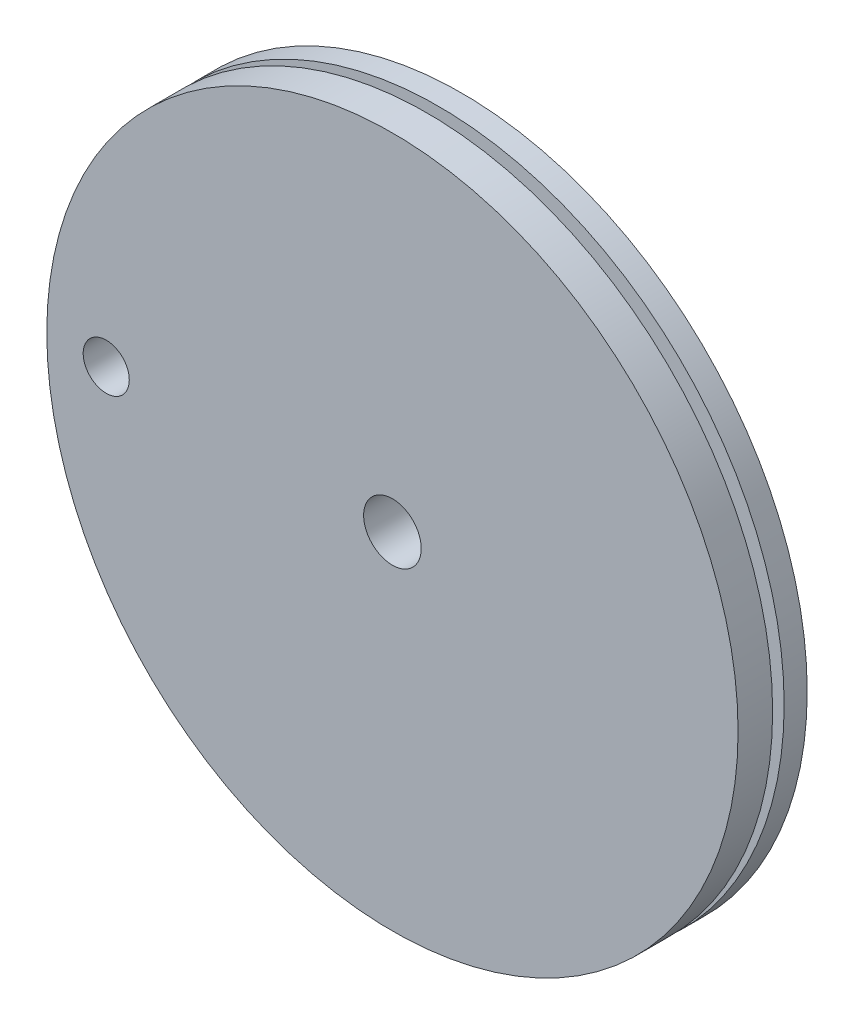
from build123d import *

# Parameters (mm, degrees)
ESQUISSE1_R             = 30
EXTRUSION2_DEPTH        = 3
ESQUISSE2_OUTSIDE_W     = 78.982
ESQUISSE2_OUTSIDE_H     = 78.982
ESQUISSE2_OUTSIDE_R     = 28.5
ENL_V_MAT_EXTRU_1_DEPTH = 1
ESQUISSE3_R             = 30
EXTRUSION3_DEPTH        = 3
ESQUISSE4_R             = 2.5
ESQUISSE4_R_2           = 2
ENL_V_MAT_EXTRU_2_DEPTH = 43.848570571


with BuildPart() as part:
    # Esquisse1 → Extrusion2 (new body)
    with BuildSketch(Plane.XY):
        Circle(ESQUISSE1_R)
    extrude(amount=EXTRUSION2_DEPTH)

    # Esquisse2 outside → Enl_v. mat.-Extru.1 (cut)
    with BuildSketch(Plane.XY.offset(3)):
        Rectangle(ESQUISSE2_OUTSIDE_W, ESQUISSE2_OUTSIDE_H)
        Circle(ESQUISSE2_OUTSIDE_R, mode=Mode.SUBTRACT)
    extrude(amount=-ENL_V_MAT_EXTRU_1_DEPTH, mode=Mode.SUBTRACT)

    # Esquisse3 → Extrusion3 (add)
    with BuildSketch(Plane.XY.offset(3)):
        Circle(ESQUISSE3_R)
    extrude(amount=EXTRUSION3_DEPTH)

    # Esquisse4 → Enl_v. mat.-Extru.2 (cut, through all)
    with BuildSketch(Plane.XY.offset(6)):
        Circle(ESQUISSE4_R)
        with Locations((-24.83974183, 0)):
            Circle(ESQUISSE4_R_2)
    extrude(amount=-ENL_V_MAT_EXTRU_2_DEPTH, mode=Mode.SUBTRACT)


solid = part.part
